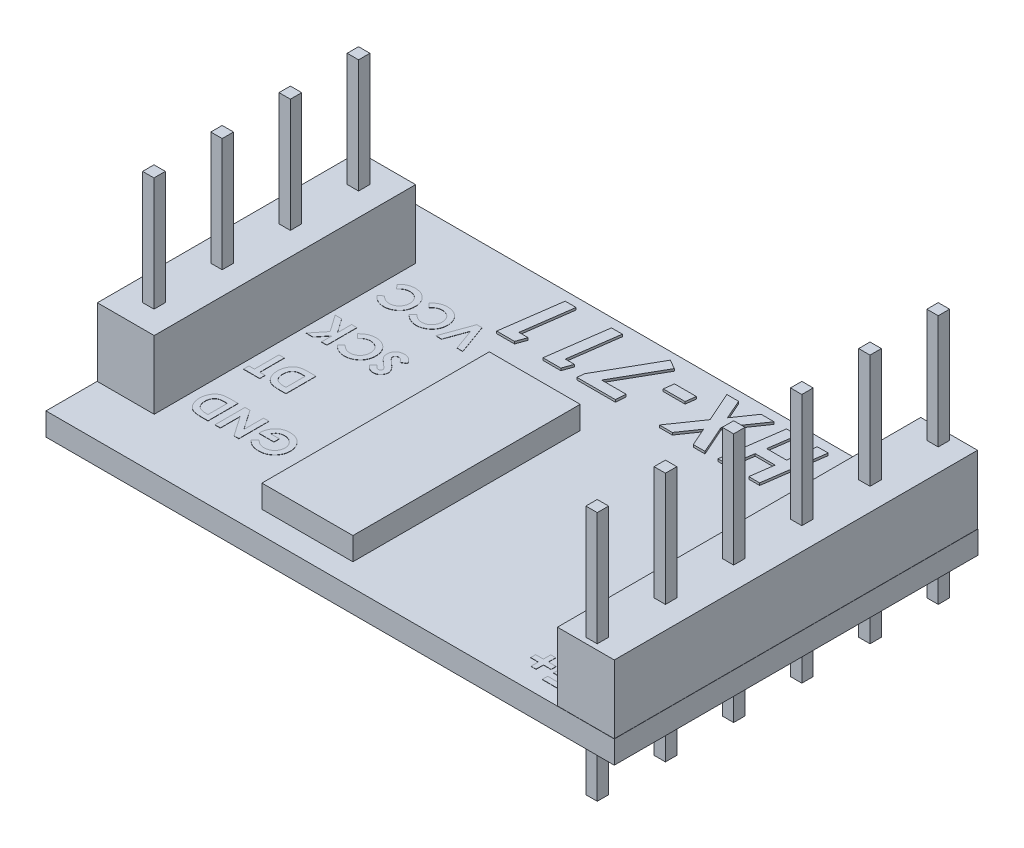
from build123d import *

# Parameters (mm, degrees)
SKETCH1_W                 = 25
SKETCH1_H                 = 16
BOSS_EXTRUDE1_DEPTH       = 1
F_4_0MM_DOWEL_HOLE1_D     = 0.5
F_4_0MM_DOWEL_HOLE1_DEPTH = 15
F_4_0MM_DOWEL_HOLE1_TIP   = 0.150215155
BOSS_EXTRUDE2_DEPTH       = 0.1
SKETCH5_W                 = 4
SKETCH5_H                 = 10
BOSS_EXTRUDE3_DEPTH       = 1
BOSS_EXTRUDE4_DEPTH       = 8
BOSS_EXTRUDE4_DEPTH_BACK  = 3
SKETCH6_W                 = 0.5
SKETCH6_H                 = 0.5
SKETCH7_W                 = 2.5
SKETCH7_H                 = 15.98
SKETCH7_H_2               = 11.5
BOSS_EXTRUDE5_DEPTH       = 3
SKETCH8_W                 = 0.457932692
SKETCH8_H                 = 0.220486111
BOSS_EXTRUDE6_DEPTH       = 0.01


with BuildPart() as part:
    # Sketch1 → Boss-Extrude1 (new body)
    with BuildSketch(Plane(origin=(0, 0, 0), x_dir=(1, 0, 0), z_dir=(0, 1, 0))):
        with Locations((12.5, -8)):
            Rectangle(SKETCH1_W, SKETCH1_H)
    extrude(amount=BOSS_EXTRUDE1_DEPTH)

    # 4.0mm Dowel Hole1
    with Locations(Plane(origin=(1.25, 1, 3.5), x_dir=(0, 0, 1), z_dir=(0, 1, 0))):
        with Locations((0, 0), (3, 0), (6, 0), (9, 0), (12, 22.5), (9, 22.5), (6, 22.5), (3, 22.5), (0, 22.5), (-3, 22.5)):
            Hole(F_4_0MM_DOWEL_HOLE1_D / 2, depth=F_4_0MM_DOWEL_HOLE1_DEPTH)
            with Locations((0, 0, -(F_4_0MM_DOWEL_HOLE1_DEPTH + F_4_0MM_DOWEL_HOLE1_TIP / 2))):  # 118° drill point
                Cone(0, F_4_0MM_DOWEL_HOLE1_D / 2, F_4_0MM_DOWEL_HOLE1_TIP, mode=Mode.SUBTRACT)

    # Sketch4 → Boss-Extrude2 (add)
    with BuildSketch(Plane(origin=(0, 1, 0), x_dir=(1, 0, 0), z_dir=(0, 1, 0))):
        Polygon((7.757428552, -3.145833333), (6.971946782, -3.145833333), (7.339776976, -0.5), (7.818910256, -0.5), (7.512561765, -2.704861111), (7.91537293, -2.704861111), align=None)
        Polygon((9.792684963, -3.145833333), (9.007203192, -3.145833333), (9.375033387, -0.5), (9.854166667, -0.5), (9.547818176, -2.704861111), (9.95062934, -2.704861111), align=None)
        Polygon((12.194711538, -3.145833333), (10.49866453, -3.145833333), (10.53258547, -2.83471471), (11.901613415, -0.43215812), (12.307604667, -0.669604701), (11.147932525, -2.704861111), (12.228632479, -2.704861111), align=None)
        Polygon((13.79959602, -1.687232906), (12.839209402, -1.687232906), (12.894330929, -1.246260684), (13.856837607, -1.246260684), align=None)
        Polygon((16.136430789, -3.145833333), (15.620196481, -3.145833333), (15.261376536, -2.332260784), (14.69797092, -3.145833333), (14.128205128, -3.145833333), (15.039300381, -1.829806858), (14.452574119, -0.5), (14.968278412, -0.5), (15.354659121, -1.374524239), (15.959935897, -0.5), (16.529701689, -0.5), (15.576205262, -1.876978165), align=None)
        Polygon((18.540047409, -3.145833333), (18.060914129, -3.145833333), (18.203488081, -2.128205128), (17.325253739, -2.128205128), (17.183209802, -3.145833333), (16.704076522, -3.145833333), (17.075086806, -0.5), (17.554220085, -0.5), (17.387795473, -1.687232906), (18.2654998, -1.687232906), (18.431924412, -0.5), (18.911057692, -0.5), align=None)
    extrude(amount=BOSS_EXTRUDE2_DEPTH)

    # Sketch5 → Boss-Extrude3 (add)
    with BuildSketch(Plane(origin=(0, 1, 0), x_dir=(1, 0, 0), z_dir=(0, 1, 0))):
        with Locations((10.5, -10)):
            Rectangle(SKETCH5_W, SKETCH5_H)
    extrude(amount=BOSS_EXTRUDE3_DEPTH)

    # Sketch6 → Boss-Extrude4 (add, two sides: drawn at the far end of the back side and taken through both)
    with BuildSketch(Plane(origin=(0, 1, 0), x_dir=(1, 0, 0), z_dir=(0, 1, 0)).offset(-BOSS_EXTRUDE4_DEPTH_BACK)):
        with Locations((1.25, -6.5)):
            Rectangle(SKETCH6_W, SKETCH6_H)
        with Locations((1.25, -3.5)):
            Rectangle(SKETCH6_W, SKETCH6_H)
        with Locations((1.25, -9.5)):
            Rectangle(SKETCH6_W, SKETCH6_H)
        with Locations((1.25, -12.5)):
            Rectangle(SKETCH6_W, SKETCH6_H)
        with Locations((23.75, -3.5)):
            Rectangle(SKETCH6_W, SKETCH6_H)
        with Locations((23.75, -0.5)):
            Rectangle(SKETCH6_W, SKETCH6_H)
        with Locations((23.75, -6.5)):
            Rectangle(SKETCH6_W, SKETCH6_H)
        with Locations((23.75, -9.5)):
            Rectangle(SKETCH6_W, SKETCH6_H)
        with Locations((23.75, -12.5)):
            Rectangle(SKETCH6_W, SKETCH6_H)
        with Locations((23.75, -15.5)):
            Rectangle(SKETCH6_W, SKETCH6_H)
    extrude(amount=BOSS_EXTRUDE4_DEPTH + BOSS_EXTRUDE4_DEPTH_BACK)

    # Sketch7 → Boss-Extrude5 (add)
    with BuildSketch(Plane(origin=(0, 1, 0), x_dir=(1, 0, 0), z_dir=(0, 1, 0))):
        with Locations((23.74, -8)):
            Rectangle(SKETCH7_W, SKETCH7_H)
        with Locations((1.26, -8)):
            Rectangle(SKETCH7_W, SKETCH7_H_2)
    extrude(amount=BOSS_EXTRUDE5_DEPTH)

    # Sketch8 → Boss-Extrude6 (add)
    # profile 1 of 23: a face of its own
    with BuildSketch(Plane(origin=(0, 1, 0), x_dir=(1, 0, 0), z_dir=(0, 1, 0))):
        Polygon((21.865941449, -15.322916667), (21.153601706, -15.322916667), (21.153601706, -15.085470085), (21.628494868, -15.085470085), (21.628494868, -14.831063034), (21.153601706, -14.831063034), (21.153601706, -14.593616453), (21.628494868, -14.593616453), (21.628494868, -14.237446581), (21.153601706, -14.237446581), (21.153601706, -14), (21.865941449, -14), align=None)
    # profile 2 of 23: a face of its own
    with BuildSketch(Plane(origin=(0, 1, 0), x_dir=(1, 0, 0), z_dir=(0, 1, 0))):
        Polygon((20.627827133, -14.746260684), (20.627827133, -15.068509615), (20.407341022, -15.068509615), (20.407341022, -14.746260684), (20.06813162, -14.746260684), (20.06813162, -14.525774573), (20.407341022, -14.525774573), (20.407341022, -14.203525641), (20.627827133, -14.203525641), (20.627827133, -14.525774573), (20.967036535, -14.525774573), (20.967036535, -14.746260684), align=None)
    # profile 3 of 23: a face of its own
    with BuildSketch(Plane(origin=(0, 1, 0), x_dir=(1, 0, 0), z_dir=(0, 1, 0))):
        Polygon((21.865941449, -12.572916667), (21.153601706, -12.572916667), (21.153601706, -12.335470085), (21.628494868, -12.335470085), (21.628494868, -12.081063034), (21.153601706, -12.081063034), (21.153601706, -11.843616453), (21.628494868, -11.843616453), (21.628494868, -11.487446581), (21.153601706, -11.487446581), (21.153601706, -11.25), (21.865941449, -11.25), align=None)
    # profile 4 of 23: a face of its own
    with BuildSketch(Plane(origin=(0, 1, 0), x_dir=(1, 0, 0), z_dir=(0, 1, 0))):
        with Locations((20.687188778, -11.733373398)):
            Rectangle(SKETCH8_W, SKETCH8_H)
    # profile 5 of 23: a face of its own
    with BuildSketch(Plane(origin=(0, 1, 0), x_dir=(1, 0, 0), z_dir=(0, 1, 0))):
        Polygon((21.45862516, -9.822916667), (21.238404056, -9.822916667), (20.704149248, -8.5), (20.957761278, -8.5), (21.060584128, -8.771367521), (21.636975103, -8.771367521), (21.739797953, -8.5), (21.993144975, -8.5), align=None)
        Polygon((21.348647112, -9.468071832), (21.546872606, -9.008814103), (21.150421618, -9.008814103), align=None, mode=Mode.SUBTRACT)
    # profile 6 of 23: a face of its own
    with BuildSketch(Plane(origin=(0, 1, 0), x_dir=(1, 0, 0), z_dir=(0, 1, 0))):
        with Locations((20.280137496, -8.983373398)):
            Rectangle(SKETCH8_W, SKETCH8_H)
    # profile 7 of 23: a face of its own
    with BuildSketch(Plane(origin=(0, 1, 0), x_dir=(1, 0, 0), z_dir=(0, 1, 0))):
        Polygon((21.45862516, -7.072916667), (21.238404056, -7.072916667), (20.704149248, -5.75), (20.957761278, -5.75), (21.060584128, -6.021367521), (21.636975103, -6.021367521), (21.739797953, -5.75), (21.993144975, -5.75), align=None)
        Polygon((21.348647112, -6.718071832), (21.546872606, -6.258814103), (21.150421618, -6.258814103), align=None, mode=Mode.SUBTRACT)
    # profile 8 of 23: a face of its own
    with BuildSketch(Plane(origin=(0, 1, 0), x_dir=(1, 0, 0), z_dir=(0, 1, 0))):
        Polygon((20.220775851, -6.496260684), (20.220775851, -6.818509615), (20.00028974, -6.818509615), (20.00028974, -6.496260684), (19.661080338, -6.496260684), (19.661080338, -6.275774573), (20.00028974, -6.275774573), (20.00028974, -5.953525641), (20.220775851, -5.953525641), (20.220775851, -6.275774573), (20.559985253, -6.275774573), (20.559985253, -6.496260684), align=None)
    # profile 9 of 23: a face of its own
    with BuildSketch(Plane(origin=(0, 1, 0), x_dir=(1, 0, 0), z_dir=(0, 1, 0))):
        with BuildLine():
            Line((21.865941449, -3), (21.865941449, -4.322916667))
            Line((21.865941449, -4.322916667), (21.653935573, -4.322916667))
            add(Edge.make_bspline(
                [(21.653935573, -4.322916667), (21.63909381, -4.322918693), (21.610375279, -4.322922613), (21.568942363, -4.321463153), (21.530603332, -4.319600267), (21.4953114, -4.317446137), (21.463079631, -4.313871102), (21.433885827, -4.310023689), (21.407838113, -4.305414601), (21.391734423, -4.301277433), (21.384158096, -4.299331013)],
                knots=[0, 0, 0, 0, 1.311970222, 2.538637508, 3.664491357, 4.705491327, 5.663608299, 6.530571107, 7.308675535, 8, 8, 8, 8], degree=3))
            add(Edge.make_bspline(
                [(21.384158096, -4.299331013), (21.374209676, -4.296585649), (21.354687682, -4.291198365), (21.326724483, -4.28032048), (21.300203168, -4.268221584), (21.275129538, -4.254445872), (21.251800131, -4.238736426), (21.229895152, -4.221392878), (21.209516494, -4.202409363), (21.190988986, -4.181673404), (21.17426598, -4.159731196), (21.159676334, -4.136572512), (21.147074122, -4.112564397), (21.1373974, -4.08729251), (21.129271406, -4.061416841), (21.123834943, -4.034411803), (21.120187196, -4.006510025), (21.119851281, -3.987517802), (21.119680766, -3.977877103)],
                knots=[0, 0, 0, 0, 1.099879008, 2.158315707, 3.195196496, 4.207130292, 5.205157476, 6.190838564, 7.183874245, 8.171129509, 9.152705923, 10.122275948, 11.08707516, 12.038677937, 13.004120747, 13.975884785, 14.972532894, 16, 16, 16, 16], degree=3))
            add(Edge.make_bspline(
                [(21.119680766, -3.977877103), (21.120094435, -3.965484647), (21.120909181, -3.941076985), (21.127161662, -3.905392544), (21.137237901, -3.871479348), (21.151476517, -3.839043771), (21.170591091, -3.808134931), (21.194427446, -3.778166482), (21.223578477, -3.74954761), (21.245567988, -3.732017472), (21.25695457, -3.722940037)],
                knots=[0, 0, 0, 0, 0.986462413, 1.942894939, 2.875435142, 3.798266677, 4.755009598, 5.761362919, 6.840791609, 8, 8, 8, 8], degree=3))
            add(Edge.make_bspline(
                [(21.25695457, -3.722940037), (21.247626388, -3.718179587), (21.229336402, -3.708845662), (21.20338608, -3.69348588), (21.179298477, -3.677215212), (21.157240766, -3.660058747), (21.136690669, -3.642357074), (21.118924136, -3.623025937), (21.102185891, -3.603557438), (21.087855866, -3.582696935), (21.075466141, -3.56089015), (21.06447479, -3.538383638), (21.055496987, -3.514729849), (21.047768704, -3.490267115), (21.041912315, -3.464742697), (21.03812468, -3.43831573), (21.035218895, -3.411001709), (21.03499318, -3.392395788), (21.034878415, -3.382935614)],
                knots=[0, 0, 0, 0, 1.164301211, 2.282872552, 3.350830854, 4.394111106, 5.389302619, 6.362088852, 7.310365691, 8.24222091, 9.170601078, 10.097577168, 11.024240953, 11.981127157, 12.948542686, 13.932080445, 14.948567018, 16, 16, 16, 16], degree=3))
            add(Edge.make_bspline(
                [(21.034878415, -3.382935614), (21.035586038, -3.364857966), (21.036983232, -3.329163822), (21.048289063, -3.276957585), (21.066334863, -3.227209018), (21.091637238, -3.180715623), (21.122467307, -3.138302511), (21.157768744, -3.100843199), (21.197576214, -3.069473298), (21.234056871, -3.048084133), (21.265777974, -3.03382228), (21.292160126, -3.025083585), (21.320476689, -3.016983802), (21.351044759, -3.010708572), (21.383711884, -3.006032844), (21.418463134, -3.002626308), (21.455418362, -3.000477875), (21.480794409, -3.000162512), (21.493871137, -3)],
                knots=[0, 0, 0, 0, 1.284225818, 2.535691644, 3.779474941, 5.035581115, 6.285533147, 7.498311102, 8.683187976, 9.876672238, 10.49522506, 11.152635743, 11.850557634, 12.588370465, 13.369094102, 14.195874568, 15.07030211, 16, 16, 16, 16], degree=3))
            Line((21.493871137, -3), (21.865941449, -3))
        make_face()
        with BuildLine():
            Line((21.628494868, -4.085470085), (21.628494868, -3.797142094))
            Line((21.628494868, -3.797142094), (21.56542312, -3.797142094))
            add(Edge.make_bspline(
                [(21.56542312, -3.797142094), (21.556850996, -3.797216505), (21.54030303, -3.79736015), (21.51640297, -3.799223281), (21.494173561, -3.802378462), (21.473644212, -3.806874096), (21.454695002, -3.812321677), (21.437550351, -3.819250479), (21.422154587, -3.827517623), (21.404014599, -3.839531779), (21.385329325, -3.85792998), (21.368597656, -3.883900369), (21.358791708, -3.913960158), (21.357694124, -3.935139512), (21.357127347, -3.946076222)],
                knots=[0, 0, 0, 0, 1.06517797, 2.056261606, 2.976983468, 3.853439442, 4.666321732, 5.424739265, 6.146762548, 6.834937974, 8.123729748, 9.372478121, 10.64318598, 12, 12, 12, 12], degree=3))
            add(Edge.make_bspline(
                [(21.357127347, -3.946076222), (21.357580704, -3.956320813), (21.358457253, -3.976128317), (21.368337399, -4.003958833), (21.383728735, -4.028494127), (21.401626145, -4.045528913), (21.418692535, -4.056981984), (21.433383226, -4.0646188), (21.449527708, -4.071399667), (21.467522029, -4.076134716), (21.486826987, -4.080579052), (21.507858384, -4.083281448), (21.530403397, -4.085276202), (21.545984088, -4.085404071), (21.554027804, -4.085470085)],
                knots=[0, 0, 0, 0, 1.347812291, 2.605940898, 3.848830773, 5.144272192, 5.83350599, 6.558918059, 7.32804622, 8.140548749, 9.012446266, 9.943019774, 10.938059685, 12, 12, 12, 12], degree=3))
            Line((21.554027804, -4.085470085), (21.628494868, -4.085470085))
        make_face(mode=Mode.SUBTRACT)
        with BuildLine():
            Line((21.628494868, -3.576655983), (21.628494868, -3.237446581))
            Line((21.628494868, -3.237446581), (21.560122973, -3.237446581))
            add(Edge.make_bspline(
                [(21.560122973, -3.237446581), (21.546606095, -3.237525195), (21.52061821, -3.23767634), (21.483385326, -3.239451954), (21.449549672, -3.242745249), (21.419103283, -3.246590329), (21.392295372, -3.252670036), (21.368636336, -3.258991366), (21.348536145, -3.267122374), (21.331651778, -3.276551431), (21.317530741, -3.287217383), (21.305302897, -3.298760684), (21.295103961, -3.311659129), (21.286901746, -3.325627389), (21.28001156, -3.340536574), (21.275790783, -3.356881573), (21.272592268, -3.374154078), (21.272415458, -3.386099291), (21.272324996, -3.392210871)],
                knots=[0, 0, 0, 0, 1.753677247, 3.371663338, 4.833688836, 6.164395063, 7.349095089, 8.3975697, 9.338276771, 10.154261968, 10.899224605, 11.628775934, 12.330426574, 13.024264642, 13.727131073, 14.452891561, 15.208446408, 16, 16, 16, 16], degree=3))
            add(Edge.make_bspline(
                [(21.272324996, -3.392210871), (21.272523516, -3.399199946), (21.27291018, -3.412812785), (21.276078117, -3.432705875), (21.281809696, -3.451290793), (21.289141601, -3.469049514), (21.29904023, -3.485497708), (21.311131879, -3.500744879), (21.325309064, -3.514835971), (21.341616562, -3.527984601), (21.360550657, -3.539795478), (21.382546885, -3.549348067), (21.407036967, -3.557965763), (21.434500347, -3.564627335), (21.464721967, -3.570341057), (21.497963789, -3.573738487), (21.533936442, -3.576270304), (21.558881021, -3.576524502), (21.571783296, -3.576655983)],
                knots=[0, 0, 0, 0, 0.844862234, 1.645564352, 2.426138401, 3.19188377, 3.963047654, 4.738710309, 5.53926994, 6.37496817, 7.267116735, 8.227971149, 9.268346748, 10.402975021, 11.641070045, 12.984514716, 14.440277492, 16, 16, 16, 16], degree=3))
            Line((21.571783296, -3.576655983), (21.628494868, -3.576655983))
        make_face(mode=Mode.SUBTRACT)
    # profile 10 of 23: a face of its own
    with BuildSketch(Plane(origin=(0, 1, 0), x_dir=(1, 0, 0), z_dir=(0, 1, 0))):
        with Locations((20.568465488, -3.483373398)):
            Rectangle(SKETCH8_W, SKETCH8_H)
    # profile 11 of 23: a face of its own
    with BuildSketch(Plane(origin=(0, 1, 0), x_dir=(1, 0, 0), z_dir=(0, 1, 0))):
        with BuildLine():
            Line((21.865941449, -0.25), (21.865941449, -1.572916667))
            Line((21.865941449, -1.572916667), (21.653935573, -1.572916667))
            add(Edge.make_bspline(
                [(21.653935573, -1.572916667), (21.63909381, -1.572918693), (21.610375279, -1.572922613), (21.568942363, -1.571463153), (21.530603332, -1.569600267), (21.4953114, -1.567446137), (21.463079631, -1.563871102), (21.433885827, -1.560023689), (21.407838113, -1.555414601), (21.391734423, -1.551277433), (21.384158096, -1.549331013)],
                knots=[0, 0, 0, 0, 1.311970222, 2.538637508, 3.664491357, 4.705491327, 5.663608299, 6.530571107, 7.308675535, 8, 8, 8, 8], degree=3))
            add(Edge.make_bspline(
                [(21.384158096, -1.549331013), (21.374209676, -1.546585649), (21.354687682, -1.541198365), (21.326724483, -1.53032048), (21.300203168, -1.518221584), (21.275129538, -1.504445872), (21.251800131, -1.488736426), (21.229895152, -1.471392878), (21.209516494, -1.452409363), (21.190988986, -1.431673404), (21.17426598, -1.409731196), (21.159676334, -1.386572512), (21.147074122, -1.362564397), (21.1373974, -1.33729251), (21.129271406, -1.311416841), (21.123834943, -1.284411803), (21.120187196, -1.256510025), (21.119851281, -1.237517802), (21.119680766, -1.227877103)],
                knots=[0, 0, 0, 0, 1.099879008, 2.158315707, 3.195196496, 4.207130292, 5.205157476, 6.190838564, 7.183874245, 8.171129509, 9.152705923, 10.122275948, 11.08707516, 12.038677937, 13.004120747, 13.975884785, 14.972532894, 16, 16, 16, 16], degree=3))
            add(Edge.make_bspline(
                [(21.119680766, -1.227877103), (21.120094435, -1.215484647), (21.120909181, -1.191076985), (21.127161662, -1.155392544), (21.137237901, -1.121479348), (21.151476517, -1.089043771), (21.170591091, -1.058134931), (21.194427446, -1.028166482), (21.223578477, -0.99954761), (21.245567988, -0.982017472), (21.25695457, -0.972940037)],
                knots=[0, 0, 0, 0, 0.986462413, 1.942894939, 2.875435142, 3.798266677, 4.755009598, 5.761362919, 6.840791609, 8, 8, 8, 8], degree=3))
            add(Edge.make_bspline(
                [(21.25695457, -0.972940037), (21.247626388, -0.968179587), (21.229336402, -0.958845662), (21.20338608, -0.94348588), (21.179298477, -0.927215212), (21.157240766, -0.910058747), (21.136690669, -0.892357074), (21.118924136, -0.873025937), (21.102185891, -0.853557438), (21.087855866, -0.832696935), (21.075466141, -0.81089015), (21.06447479, -0.788383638), (21.055496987, -0.764729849), (21.047768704, -0.740267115), (21.041912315, -0.714742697), (21.03812468, -0.68831573), (21.035218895, -0.661001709), (21.03499318, -0.642395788), (21.034878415, -0.632935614)],
                knots=[0, 0, 0, 0, 1.164301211, 2.282872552, 3.350830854, 4.394111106, 5.389302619, 6.362088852, 7.310365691, 8.24222091, 9.170601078, 10.097577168, 11.024240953, 11.981127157, 12.948542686, 13.932080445, 14.948567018, 16, 16, 16, 16], degree=3))
            add(Edge.make_bspline(
                [(21.034878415, -0.632935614), (21.035586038, -0.614857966), (21.036983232, -0.579163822), (21.048289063, -0.526957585), (21.066334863, -0.477209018), (21.091637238, -0.430715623), (21.122467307, -0.388302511), (21.157768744, -0.350843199), (21.197576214, -0.319473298), (21.234056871, -0.298084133), (21.265777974, -0.28382228), (21.292160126, -0.275083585), (21.320476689, -0.266983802), (21.351044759, -0.260708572), (21.383711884, -0.256032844), (21.418463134, -0.252626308), (21.455418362, -0.250477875), (21.480794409, -0.250162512), (21.493871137, -0.25)],
                knots=[0, 0, 0, 0, 1.284225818, 2.535691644, 3.779474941, 5.035581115, 6.285533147, 7.498311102, 8.683187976, 9.876672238, 10.49522506, 11.152635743, 11.850557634, 12.588370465, 13.369094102, 14.195874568, 15.07030211, 16, 16, 16, 16], degree=3))
            Line((21.493871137, -0.25), (21.865941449, -0.25))
        make_face()
        with BuildLine():
            Line((21.628494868, -1.335470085), (21.628494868, -1.047142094))
            Line((21.628494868, -1.047142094), (21.56542312, -1.047142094))
            add(Edge.make_bspline(
                [(21.56542312, -1.047142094), (21.556850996, -1.047216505), (21.54030303, -1.04736015), (21.51640297, -1.049223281), (21.494173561, -1.052378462), (21.473644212, -1.056874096), (21.454695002, -1.062321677), (21.437550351, -1.069250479), (21.422154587, -1.077517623), (21.404014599, -1.089531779), (21.385329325, -1.10792998), (21.368597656, -1.133900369), (21.358791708, -1.163960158), (21.357694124, -1.185139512), (21.357127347, -1.196076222)],
                knots=[0, 0, 0, 0, 1.06517797, 2.056261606, 2.976983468, 3.853439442, 4.666321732, 5.424739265, 6.146762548, 6.834937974, 8.123729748, 9.372478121, 10.64318598, 12, 12, 12, 12], degree=3))
            add(Edge.make_bspline(
                [(21.357127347, -1.196076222), (21.357580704, -1.206320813), (21.358457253, -1.226128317), (21.368337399, -1.253958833), (21.383728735, -1.278494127), (21.401626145, -1.295528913), (21.418692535, -1.306981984), (21.433383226, -1.3146188), (21.449527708, -1.321399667), (21.467522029, -1.326134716), (21.486826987, -1.330579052), (21.507858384, -1.333281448), (21.530403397, -1.335276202), (21.545984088, -1.335404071), (21.554027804, -1.335470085)],
                knots=[0, 0, 0, 0, 1.347812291, 2.605940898, 3.848830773, 5.144272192, 5.83350599, 6.558918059, 7.32804622, 8.140548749, 9.012446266, 9.943019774, 10.938059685, 12, 12, 12, 12], degree=3))
            Line((21.554027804, -1.335470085), (21.628494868, -1.335470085))
        make_face(mode=Mode.SUBTRACT)
        with BuildLine():
            Line((21.628494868, -0.826655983), (21.628494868, -0.487446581))
            Line((21.628494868, -0.487446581), (21.560122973, -0.487446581))
            add(Edge.make_bspline(
                [(21.560122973, -0.487446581), (21.546606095, -0.487525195), (21.52061821, -0.48767634), (21.483385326, -0.489451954), (21.449549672, -0.492745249), (21.419103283, -0.496590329), (21.392295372, -0.502670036), (21.368636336, -0.508991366), (21.348536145, -0.517122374), (21.331651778, -0.526551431), (21.317530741, -0.537217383), (21.305302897, -0.548760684), (21.295103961, -0.561659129), (21.286901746, -0.575627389), (21.28001156, -0.590536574), (21.275790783, -0.606881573), (21.272592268, -0.624154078), (21.272415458, -0.636099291), (21.272324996, -0.642210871)],
                knots=[0, 0, 0, 0, 1.753677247, 3.371663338, 4.833688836, 6.164395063, 7.349095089, 8.3975697, 9.338276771, 10.154261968, 10.899224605, 11.628775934, 12.330426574, 13.024264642, 13.727131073, 14.452891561, 15.208446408, 16, 16, 16, 16], degree=3))
            add(Edge.make_bspline(
                [(21.272324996, -0.642210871), (21.272523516, -0.649199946), (21.27291018, -0.662812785), (21.276078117, -0.682705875), (21.281809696, -0.701290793), (21.289141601, -0.719049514), (21.29904023, -0.735497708), (21.311131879, -0.750744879), (21.325309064, -0.764835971), (21.341616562, -0.777984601), (21.360550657, -0.789795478), (21.382546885, -0.799348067), (21.407036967, -0.807965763), (21.434500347, -0.814627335), (21.464721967, -0.820341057), (21.497963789, -0.823738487), (21.533936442, -0.826270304), (21.558881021, -0.826524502), (21.571783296, -0.826655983)],
                knots=[0, 0, 0, 0, 0.844862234, 1.645564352, 2.426138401, 3.19188377, 3.963047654, 4.738710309, 5.53926994, 6.37496817, 7.267116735, 8.227971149, 9.268346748, 10.402975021, 11.641070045, 12.984514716, 14.440277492, 16, 16, 16, 16], degree=3))
            Line((21.571783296, -0.826655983), (21.628494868, -0.826655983))
        make_face(mode=Mode.SUBTRACT)
    # profile 12 of 23: a face of its own
    with BuildSketch(Plane(origin=(0, 1, 0), x_dir=(1, 0, 0), z_dir=(0, 1, 0))):
        Polygon((20.509103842, -0.996260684), (20.509103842, -1.318509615), (20.288617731, -1.318509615), (20.288617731, -0.996260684), (19.94940833, -0.996260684), (19.94940833, -0.775774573), (20.288617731, -0.775774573), (20.288617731, -0.453525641), (20.509103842, -0.453525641), (20.509103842, -0.775774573), (20.848313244, -0.775774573), (20.848313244, -0.996260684), align=None)
    # profile 13 of 23: a face of its own
    with BuildSketch(Plane(origin=(0, 1, 0), x_dir=(1, 0, 0), z_dir=(0, 1, 0))):
        with BuildLine():
            Line((3.95025805, -12.822916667), (3.651064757, -12.822916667))
            add(Edge.make_bspline(
                [(3.651064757, -12.822916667), (3.627738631, -12.822757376), (3.582648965, -12.822449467), (3.517332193, -12.818847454), (3.45655049, -12.813558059), (3.400441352, -12.80546288), (3.348802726, -12.796067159), (3.302015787, -12.783484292), (3.259699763, -12.769044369), (3.221410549, -12.752219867), (3.186551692, -12.73248862), (3.153686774, -12.710321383), (3.122436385, -12.685385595), (3.092627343, -12.657623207), (3.064187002, -12.627218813), (3.037782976, -12.593560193), (3.012568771, -12.55751915), (2.988953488, -12.518970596), (2.967932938, -12.477990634), (2.949222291, -12.43522426), (2.933632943, -12.390643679), (2.920939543, -12.344310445), (2.910828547, -12.296358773), (2.903752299, -12.2466973), (2.899378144, -12.19537051), (2.898934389, -12.160583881), (2.898708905, -12.142907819)],
                knots=[0, 0, 0, 0, 1.44349102, 2.790284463, 4.047513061, 5.218094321, 6.297837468, 7.293772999, 8.213586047, 9.062895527, 9.878013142, 10.689252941, 11.514048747, 12.349645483, 13.208421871, 14.087867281, 14.994836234, 15.929653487, 16.883274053, 17.843080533, 18.816554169, 19.803369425, 20.81449504, 21.847452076, 22.906230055, 24, 24, 24, 24], degree=3))
            add(Edge.make_bspline(
                [(2.898708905, -12.142907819), (2.899299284, -12.117965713), (2.900461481, -12.068865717), (2.910252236, -11.996812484), (2.926084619, -11.927740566), (2.9483554, -11.862198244), (2.975933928, -11.800740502), (3.008962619, -11.744598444), (3.046492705, -11.693657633), (3.088857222, -11.64876328), (3.134655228, -11.609939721), (3.182435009, -11.577077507), (3.232153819, -11.550699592), (3.276055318, -11.534227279), (3.314230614, -11.523874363), (3.347698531, -11.517860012), (3.385787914, -11.512281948), (3.42864232, -11.507487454), (3.476388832, -11.504204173), (3.528879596, -11.501936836), (3.586127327, -11.50025206), (3.625887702, -11.500086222), (3.646559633, -11.5)],
                knots=[0, 0, 0, 0, 1.315347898, 2.589339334, 3.828278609, 5.048487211, 6.235212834, 7.375728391, 8.47833097, 9.56625089, 10.624194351, 11.640157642, 12.619895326, 13.585848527, 14.106971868, 14.704705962, 15.37825295, 16.137840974, 16.978850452, 17.902510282, 18.909488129, 20, 20, 20, 20], degree=3))
            Line((3.646559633, -11.5), (3.95025805, -11.5))
            Line((3.95025805, -11.5), (3.95025805, -12.822916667))
        make_face()
        with BuildLine():
            Line((3.712811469, -12.585470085), (3.712811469, -11.737446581))
            Line((3.712811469, -11.737446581), (3.588788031, -11.737446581))
            add(Edge.make_bspline(
                [(3.588788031, -11.737446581), (3.574033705, -11.737518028), (3.545660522, -11.737655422), (3.50464602, -11.739543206), (3.466795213, -11.742608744), (3.432058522, -11.747143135), (3.400356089, -11.752599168), (3.371803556, -11.759347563), (3.346344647, -11.767554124), (3.323769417, -11.777225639), (3.303158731, -11.78826782), (3.284064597, -11.801161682), (3.265636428, -11.815490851), (3.248214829, -11.831663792), (3.231734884, -11.849469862), (3.216294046, -11.868999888), (3.201685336, -11.890194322), (3.18828749, -11.913166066), (3.176032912, -11.937668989), (3.165206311, -11.963479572), (3.156066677, -11.990738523), (3.149126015, -12.019433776), (3.143213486, -12.049387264), (3.138944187, -12.080791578), (3.136618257, -12.11354412), (3.136311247, -12.135837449), (3.136155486, -12.147147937)],
                knots=[0, 0, 0, 0, 1.502729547, 2.8898115, 4.181010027, 5.369596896, 6.45687185, 7.456390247, 8.355533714, 9.177830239, 9.954819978, 10.733423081, 11.521791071, 12.330436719, 13.151797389, 13.990712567, 14.864234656, 15.771624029, 16.697123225, 17.652960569, 18.620374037, 19.622036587, 20.657870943, 21.729319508, 22.8479736, 24, 24, 24, 24], degree=3))
            add(Edge.make_bspline(
                [(3.136155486, -12.147147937), (3.136470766, -12.164479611), (3.137085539, -12.198275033), (3.143051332, -12.24749223), (3.152663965, -12.293779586), (3.166666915, -12.337018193), (3.183886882, -12.377482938), (3.20578243, -12.414652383), (3.231023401, -12.449135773), (3.250994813, -12.469361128), (3.260973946, -12.479467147)],
                knots=[0, 0, 0, 0, 1.138242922, 2.219485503, 3.251901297, 4.239342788, 5.201071, 6.134757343, 7.067992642, 8, 8, 8, 8], degree=3))
            add(Edge.make_bspline(
                [(3.260973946, -12.479467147), (3.270813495, -12.488079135), (3.290909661, -12.505668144), (3.326191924, -12.526744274), (3.365071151, -12.545261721), (3.408436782, -12.559943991), (3.455869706, -12.571555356), (3.507652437, -12.579563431), (3.563507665, -12.584709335), (3.602202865, -12.585211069), (3.622178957, -12.585470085)],
                knots=[0, 0, 0, 0, 0.813307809, 1.661089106, 2.549956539, 3.493439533, 4.508053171, 5.589449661, 6.755572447, 8, 8, 8, 8], degree=3))
            Line((3.622178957, -12.585470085), (3.712811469, -12.585470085))
        make_face(mode=Mode.SUBTRACT)
    # profile 14 of 23: a face of its own
    with BuildSketch(Plane(origin=(0, 1, 0), x_dir=(1, 0, 0), z_dir=(0, 1, 0))):
        Polygon((5.307095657, -12.822916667), (5.093234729, -12.822916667), (4.492993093, -11.952367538), (4.492993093, -12.822916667), (4.255546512, -12.822916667), (4.255546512, -11.5), (4.470997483, -11.5), (5.069649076, -12.367899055), (5.069649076, -11.5), (5.307095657, -11.5), align=None)
    # profile 15 of 23: a face of its own
    with BuildSketch(Plane(origin=(0, 1, 0), x_dir=(1, 0, 0), z_dir=(0, 1, 0))):
        with BuildLine():
            Line((5.638089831, -12.612500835), (5.817764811, -12.440511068))
            add(Edge.make_bspline(
                [(5.817764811, -12.440511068), (5.831989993, -12.454753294), (5.859902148, -12.482698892), (5.905548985, -12.519072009), (5.952825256, -12.54999635), (6.001886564, -12.575424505), (6.052801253, -12.595148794), (6.105468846, -12.609258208), (6.159975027, -12.617626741), (6.196873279, -12.618798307), (6.215540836, -12.619391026)],
                knots=[0, 0, 0, 0, 1.075575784, 2.110457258, 3.113929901, 4.09197124, 5.059417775, 6.02750972, 7.002078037, 8, 8, 8, 8], degree=3))
            add(Edge.make_bspline(
                [(6.215540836, -12.619391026), (6.23172502, -12.618975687), (6.263504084, -12.618160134), (6.310200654, -12.611967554), (6.354820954, -12.601621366), (6.397581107, -12.587294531), (6.438200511, -12.568628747), (6.476925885, -12.546045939), (6.513315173, -12.518981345), (6.547522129, -12.48852525), (6.578605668, -12.455024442), (6.606099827, -12.419466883), (6.629305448, -12.381904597), (6.648169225, -12.342533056), (6.662862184, -12.301504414), (6.673141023, -12.258676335), (6.679727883, -12.214134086), (6.680501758, -12.1837423), (6.680893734, -12.168348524)],
                knots=[0, 0, 0, 0, 1.07509559, 2.111044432, 3.123295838, 4.114414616, 5.101929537, 6.088414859, 7.087392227, 8.109987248, 9.127465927, 10.119435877, 11.091852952, 12.055283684, 13.015060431, 13.981632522, 14.977674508, 16, 16, 16, 16], degree=3))
            add(Edge.make_bspline(
                [(6.680893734, -12.168348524), (6.680524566, -12.152423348), (6.679797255, -12.12104857), (6.6728963, -12.074987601), (6.662078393, -12.030769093), (6.646934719, -11.988341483), (6.627193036, -11.947825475), (6.602886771, -11.909289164), (6.57437472, -11.872562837), (6.541906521, -11.838148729), (6.506567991, -11.806450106), (6.468326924, -11.77904201), (6.42825291, -11.755647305), (6.386092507, -11.736250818), (6.341702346, -11.721941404), (6.295464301, -11.711152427), (6.247170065, -11.704713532), (6.214234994, -11.703925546), (6.197520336, -11.703525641)],
                knots=[0, 0, 0, 0, 1.021985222, 2.013450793, 2.98331293, 3.941376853, 4.900279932, 5.871285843, 6.861761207, 7.88100394, 8.905520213, 9.905129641, 10.896449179, 11.881305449, 12.878594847, 13.885755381, 14.927013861, 16, 16, 16, 16], degree=3))
            add(Edge.make_bspline(
                [(6.197520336, -11.703525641), (6.186647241, -11.703623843), (6.165300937, -11.703816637), (6.133988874, -11.706941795), (6.104001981, -11.711416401), (6.075212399, -11.717316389), (6.047873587, -11.725777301), (6.02161452, -11.735351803), (5.996780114, -11.747214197), (5.973153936, -11.760675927), (5.950714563, -11.776180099), (5.929534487, -11.793656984), (5.909542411, -11.81326569), (5.890393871, -11.834630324), (5.872738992, -11.858374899), (5.85595328, -11.883910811), (5.840257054, -11.911520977), (5.830981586, -11.93101669), (5.826245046, -11.940972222)],
                knots=[0, 0, 0, 0, 1.109467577, 2.178131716, 3.208562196, 4.204278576, 5.174223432, 6.127254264, 7.054993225, 7.9799672, 8.900446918, 9.835649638, 10.779420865, 11.756673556, 12.761211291, 13.796640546, 14.874849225, 16, 16, 16, 16], degree=3))
            Line((5.826245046, -11.940972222), (6.206000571, -11.940972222))
            Line((6.206000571, -11.940972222), (6.206000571, -12.178418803))
            Line((6.206000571, -12.178418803), (5.54639729, -12.178418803))
            Line((5.54639729, -12.178418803), (5.544542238, -12.121972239))
            add(Edge.make_bspline(
                [(5.544542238, -12.121972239), (5.544780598, -12.107475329), (5.545256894, -12.07850738), (5.549609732, -12.035379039), (5.556820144, -11.992822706), (5.566677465, -11.950881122), (5.579031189, -11.909348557), (5.594786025, -11.868622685), (5.613234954, -11.828427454), (5.633905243, -11.788933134), (5.657134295, -11.751038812), (5.682138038, -11.715152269), (5.70858611, -11.681361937), (5.736917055, -11.650088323), (5.767069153, -11.621365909), (5.798678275, -11.594832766), (5.831755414, -11.57025728), (5.866886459, -11.548592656), (5.903480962, -11.529277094), (5.941536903, -11.512104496), (5.981277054, -11.497918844), (6.02252326, -11.48619434), (6.065294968, -11.477175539), (6.109574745, -11.47098434), (6.155391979, -11.466779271), (6.186468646, -11.466315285), (6.202290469, -11.46607906)],
                knots=[0, 0, 0, 0, 1.006947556, 2.012098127, 3.007912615, 4.003802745, 5.003693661, 6.015789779, 7.034654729, 8.075083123, 9.110776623, 10.12033905, 11.112364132, 12.089932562, 13.049221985, 14.003156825, 14.955669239, 15.909347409, 16.867458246, 17.828943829, 18.807340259, 19.796171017, 20.806031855, 21.841452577, 22.901035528, 24, 24, 24, 24], degree=3))
            add(Edge.make_bspline(
                [(6.202290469, -11.46607906), (6.219170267, -11.466317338), (6.252631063, -11.466789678), (6.302038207, -11.471039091), (6.350009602, -11.478443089), (6.396711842, -11.487604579), (6.441903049, -11.500679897), (6.485878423, -11.515740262), (6.528209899, -11.534375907), (6.569245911, -11.555081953), (6.608458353, -11.578804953), (6.645871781, -11.604641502), (6.680974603, -11.633155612), (6.713914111, -11.664054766), (6.744924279, -11.697070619), (6.773701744, -11.732647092), (6.800505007, -11.770440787), (6.82467884, -11.810702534), (6.846630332, -11.852334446), (6.865762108, -11.895086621), (6.881903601, -11.938566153), (6.895340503, -11.982873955), (6.905538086, -12.028060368), (6.913090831, -12.074060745), (6.917291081, -12.120833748), (6.917989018, -12.152263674), (6.918340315, -12.168083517)],
                knots=[0, 0, 0, 0, 1.084248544, 2.149304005, 3.182186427, 4.201621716, 5.204046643, 6.201899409, 7.185482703, 8.172726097, 9.152750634, 10.127173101, 11.09142983, 12.055001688, 13.026594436, 13.998833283, 14.992319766, 16.000574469, 17.013370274, 18.014203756, 19.007155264, 19.990967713, 20.986267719, 21.980774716, 22.98364929, 24, 24, 24, 24], degree=3))
            add(Edge.make_bspline(
                [(6.918340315, -12.168083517), (6.917872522, -12.189665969), (6.916948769, -12.232284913), (6.908360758, -12.295056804), (6.895067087, -12.355723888), (6.875704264, -12.414118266), (6.851294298, -12.470475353), (6.821507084, -12.524745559), (6.786095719, -12.576859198), (6.758672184, -12.609120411), (6.744760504, -12.625486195)],
                knots=[0, 0, 0, 0, 1.034063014, 2.041967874, 3.031271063, 4.007437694, 4.986016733, 5.971461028, 6.970942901, 8, 8, 8, 8], degree=3))
            add(Edge.make_bspline(
                [(6.744760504, -12.625486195), (6.73612348, -12.634954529), (6.718979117, -12.653749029), (6.691573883, -12.67986437), (6.663473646, -12.704413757), (6.634289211, -12.726876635), (6.604173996, -12.747744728), (6.573041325, -12.766626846), (6.541054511, -12.784124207), (6.507964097, -12.799343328), (6.473943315, -12.812988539), (6.438841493, -12.824534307), (6.402921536, -12.834761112), (6.365865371, -12.842541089), (6.328047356, -12.849019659), (6.289199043, -12.853361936), (6.249426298, -12.856544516), (6.222526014, -12.856739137), (6.208915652, -12.856837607)],
                knots=[0, 0, 0, 0, 1.020590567, 2.025856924, 3.013483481, 3.991664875, 4.957826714, 5.930500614, 6.890802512, 7.860442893, 8.829981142, 9.809047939, 10.802672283, 11.803273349, 12.823572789, 13.857849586, 14.916166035, 16, 16, 16, 16], degree=3))
            add(Edge.make_bspline(
                [(6.208915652, -12.856837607), (6.194688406, -12.856618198), (6.166381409, -12.856181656), (6.124293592, -12.853161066), (6.082790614, -12.848501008), (6.042047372, -12.841510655), (6.001927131, -12.832890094), (5.962637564, -12.821845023), (5.923922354, -12.809295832), (5.898718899, -12.79929069), (5.886136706, -12.794295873)],
                knots=[0, 0, 0, 0, 1.03180557, 2.052914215, 3.058998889, 4.059601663, 5.049854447, 6.033765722, 7.018406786, 8, 8, 8, 8], degree=3))
            add(Edge.make_bspline(
                [(5.886136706, -12.794295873), (5.875549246, -12.78968131), (5.854014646, -12.780295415), (5.822705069, -12.763093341), (5.791189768, -12.744120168), (5.760323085, -12.722134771), (5.729211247, -12.698384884), (5.698489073, -12.672046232), (5.667926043, -12.643361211), (5.648164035, -12.622920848), (5.638089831, -12.612500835)],
                knots=[0, 0, 0, 0, 0.894422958, 1.819231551, 2.765348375, 3.743239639, 4.753552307, 5.797344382, 6.877138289, 8, 8, 8, 8], degree=3))
        make_face()
    # profile 16 of 23: a face of its own
    with BuildSketch(Plane(origin=(0, 1, 0), x_dir=(1, 0, 0), z_dir=(0, 1, 0))):
        Polygon((3.475364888, -10.072916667), (2.763025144, -10.072916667), (2.763025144, -9.835470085), (3.000471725, -9.835470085), (3.000471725, -8.75), (3.237918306, -8.75), (3.237918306, -9.835470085), (3.475364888, -9.835470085), align=None)
    # profile 17 of 23: a face of its own
    with BuildSketch(Plane(origin=(0, 1, 0), x_dir=(1, 0, 0), z_dir=(0, 1, 0))):
        with BuildLine():
            Line((4.628676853, -10.072916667), (4.329483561, -10.072916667))
            add(Edge.make_bspline(
                [(4.329483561, -10.072916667), (4.306157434, -10.072757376), (4.261067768, -10.072449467), (4.195750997, -10.068847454), (4.134969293, -10.063558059), (4.078860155, -10.05546288), (4.02722153, -10.046067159), (3.980434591, -10.033484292), (3.938118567, -10.019044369), (3.899829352, -10.002219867), (3.864970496, -9.98248862), (3.832105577, -9.960321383), (3.800855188, -9.935385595), (3.771046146, -9.907623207), (3.742605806, -9.877218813), (3.716201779, -9.843560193), (3.690987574, -9.80751915), (3.667372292, -9.768970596), (3.646351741, -9.727990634), (3.627641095, -9.68522426), (3.612051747, -9.640643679), (3.599358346, -9.594310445), (3.589247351, -9.546358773), (3.582171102, -9.4966973), (3.577796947, -9.44537051), (3.577353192, -9.410583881), (3.577127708, -9.392907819)],
                knots=[0, 0, 0, 0, 1.44349102, 2.790284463, 4.047513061, 5.218094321, 6.297837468, 7.293772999, 8.213586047, 9.062895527, 9.878013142, 10.689252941, 11.514048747, 12.349645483, 13.208421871, 14.087867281, 14.994836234, 15.929653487, 16.883274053, 17.843080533, 18.816554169, 19.803369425, 20.81449504, 21.847452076, 22.906230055, 24, 24, 24, 24], degree=3))
            add(Edge.make_bspline(
                [(3.577127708, -9.392907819), (3.577718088, -9.367965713), (3.578880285, -9.318865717), (3.588671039, -9.246812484), (3.604503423, -9.177740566), (3.626774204, -9.112198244), (3.654352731, -9.050740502), (3.687381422, -8.994598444), (3.724911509, -8.943657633), (3.767276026, -8.89876328), (3.813074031, -8.859939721), (3.860853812, -8.827077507), (3.910572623, -8.800699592), (3.954474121, -8.784227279), (3.992649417, -8.773874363), (4.026117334, -8.767860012), (4.064206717, -8.762281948), (4.107061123, -8.757487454), (4.154807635, -8.754204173), (4.207298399, -8.751936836), (4.26454613, -8.75025206), (4.304306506, -8.750086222), (4.324978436, -8.75)],
                knots=[0, 0, 0, 0, 1.315347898, 2.589339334, 3.828278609, 5.048487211, 6.235212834, 7.375728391, 8.47833097, 9.56625089, 10.624194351, 11.640157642, 12.619895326, 13.585848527, 14.106971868, 14.704705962, 15.37825295, 16.137840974, 16.978850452, 17.902510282, 18.909488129, 20, 20, 20, 20], degree=3))
            Line((4.324978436, -8.75), (4.628676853, -8.75))
            Line((4.628676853, -8.75), (4.628676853, -10.072916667))
        make_face()
        with BuildLine():
            Line((4.391230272, -9.835470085), (4.391230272, -8.987446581))
            Line((4.391230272, -8.987446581), (4.267206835, -8.987446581))
            add(Edge.make_bspline(
                [(4.267206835, -8.987446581), (4.252452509, -8.987518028), (4.224079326, -8.987655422), (4.183064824, -8.989543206), (4.145214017, -8.992608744), (4.110477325, -8.997143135), (4.078774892, -9.002599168), (4.05022236, -9.009347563), (4.024763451, -9.017554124), (4.002188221, -9.027225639), (3.981577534, -9.03826782), (3.9624834, -9.051161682), (3.944055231, -9.065490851), (3.926633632, -9.081663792), (3.910153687, -9.099469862), (3.894712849, -9.118999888), (3.880104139, -9.140194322), (3.866706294, -9.163166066), (3.854451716, -9.187668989), (3.843625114, -9.213479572), (3.83448548, -9.240738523), (3.827544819, -9.269433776), (3.821632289, -9.299387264), (3.81736299, -9.330791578), (3.815037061, -9.36354412), (3.814730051, -9.385837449), (3.814574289, -9.397147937)],
                knots=[0, 0, 0, 0, 1.502729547, 2.8898115, 4.181010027, 5.369596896, 6.45687185, 7.456390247, 8.355533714, 9.177830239, 9.954819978, 10.733423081, 11.521791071, 12.330436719, 13.151797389, 13.990712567, 14.864234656, 15.771624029, 16.697123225, 17.652960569, 18.620374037, 19.622036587, 20.657870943, 21.729319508, 22.8479736, 24, 24, 24, 24], degree=3))
            add(Edge.make_bspline(
                [(3.814574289, -9.397147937), (3.81488957, -9.414479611), (3.815504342, -9.448275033), (3.821470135, -9.49749223), (3.831082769, -9.543779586), (3.845085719, -9.587018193), (3.862305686, -9.627482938), (3.884201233, -9.664652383), (3.909442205, -9.699135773), (3.929413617, -9.719361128), (3.939392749, -9.729467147)],
                knots=[0, 0, 0, 0, 1.138242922, 2.219485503, 3.251901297, 4.239342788, 5.201071, 6.134757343, 7.067992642, 8, 8, 8, 8], degree=3))
            add(Edge.make_bspline(
                [(3.939392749, -9.729467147), (3.949232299, -9.738079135), (3.969328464, -9.755668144), (4.004610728, -9.776744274), (4.043489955, -9.795261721), (4.086855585, -9.809943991), (4.13428851, -9.821555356), (4.18607124, -9.829563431), (4.241926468, -9.834709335), (4.280621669, -9.835211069), (4.30059776, -9.835470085)],
                knots=[0, 0, 0, 0, 0.813307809, 1.661089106, 2.549956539, 3.493439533, 4.508053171, 5.589449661, 6.755572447, 8, 8, 8, 8], degree=3))
            Line((4.30059776, -9.835470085), (4.391230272, -9.835470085))
        make_face(mode=Mode.SUBTRACT)
    # profile 18 of 23: a face of its own
    with BuildSketch(Plane(origin=(0, 1, 0), x_dir=(1, 0, 0), z_dir=(0, 1, 0))):
        Polygon((3.678890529, -7.322916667), (3.441443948, -7.322916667), (3.441443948, -6.857298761), (3.066193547, -7.322916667), (2.76647024, -7.322916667), (3.237918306, -6.737780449), (2.720623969, -6), (3.006566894, -6), (3.441443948, -6.620382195), (3.441443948, -6), (3.678890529, -6), align=None)
    # profile 19 of 23: a face of its own
    with BuildSketch(Plane(origin=(0, 1, 0), x_dir=(1, 0, 0), z_dir=(0, 1, 0))):
        with BuildLine():
            Line((3.91633711, -7.093420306), (4.090446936, -6.926995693))
            add(Edge.make_bspline(
                [(4.090446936, -6.926995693), (4.105199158, -6.942289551), (4.134061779, -6.972211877), (4.180791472, -7.01138346), (4.228831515, -7.04467439), (4.27831637, -7.071808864), (4.32921761, -7.093343), (4.381623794, -7.108365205), (4.435408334, -7.117824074), (4.471753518, -7.118865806), (4.490078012, -7.119391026)],
                knots=[0, 0, 0, 0, 1.115370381, 2.182214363, 3.196266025, 4.180416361, 5.141116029, 6.092551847, 7.038303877, 8, 8, 8, 8], degree=3))
            add(Edge.make_bspline(
                [(4.490078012, -7.119391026), (4.505379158, -7.118967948), (4.535574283, -7.118133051), (4.57990445, -7.111997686), (4.622324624, -7.101603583), (4.662868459, -7.087155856), (4.701736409, -7.068961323), (4.738566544, -7.046092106), (4.773556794, -7.019311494), (4.806298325, -6.98866635), (4.835856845, -6.954936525), (4.862489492, -6.919412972), (4.884549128, -6.881467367), (4.902556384, -6.841653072), (4.916746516, -6.79995571), (4.926817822, -6.756377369), (4.932653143, -6.710819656), (4.933523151, -6.679848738), (4.933965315, -6.664108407)],
                knots=[0, 0, 0, 0, 1.035268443, 2.04298821, 3.02163646, 3.985902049, 4.951223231, 5.920091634, 6.913651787, 7.92868536, 8.949353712, 9.945284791, 10.92850487, 11.913014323, 12.897904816, 13.904240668, 14.934873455, 16, 16, 16, 16], degree=3))
            add(Edge.make_bspline(
                [(4.933965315, -6.664108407), (4.933836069, -6.653061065), (4.933581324, -6.631286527), (4.930863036, -6.5991587), (4.926348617, -6.567919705), (4.920016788, -6.537662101), (4.912045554, -6.508255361), (4.902289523, -6.479891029), (4.890493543, -6.452532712), (4.877291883, -6.426037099), (4.86255601, -6.4006287), (4.846037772, -6.376644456), (4.827922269, -6.354270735), (4.808934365, -6.33272901), (4.787816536, -6.313279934), (4.765514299, -6.294851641), (4.74170766, -6.277900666), (4.716425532, -6.262662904), (4.690422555, -6.248461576), (4.663165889, -6.236701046), (4.635417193, -6.22612903), (4.60668966, -6.218175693), (4.577489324, -6.211257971), (4.547409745, -6.207033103), (4.516736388, -6.203822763), (4.496005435, -6.203625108), (4.485572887, -6.203525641)],
                knots=[0, 0, 0, 0, 1.103833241, 2.175677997, 3.219414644, 4.256521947, 5.263082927, 6.262573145, 7.25136242, 8.238376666, 9.219530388, 10.184343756, 11.145312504, 12.095474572, 13.051075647, 14.010745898, 14.985684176, 15.968306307, 16.959653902, 17.943861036, 18.93268972, 19.924626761, 20.920484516, 21.929288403, 22.957944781, 24, 24, 24, 24], degree=3))
            add(Edge.make_bspline(
                [(4.485572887, -6.203525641), (4.467877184, -6.204036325), (4.433109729, -6.205039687), (4.382091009, -6.212920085), (4.333335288, -6.225824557), (4.294456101, -6.241346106), (4.264034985, -6.256435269), (4.240887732, -6.270192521), (4.217052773, -6.285775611), (4.192693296, -6.303616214), (4.167677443, -6.323502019), (4.142434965, -6.345848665), (4.116323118, -6.369926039), (4.09921737, -6.38711029), (4.090446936, -6.395920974)],
                knots=[0, 0, 0, 0, 1.404640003, 2.759752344, 4.088613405, 5.401587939, 6.076032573, 6.783413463, 7.538272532, 8.336594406, 9.180107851, 10.074881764, 11.012956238, 12, 12, 12, 12], degree=3))
            Line((4.090446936, -6.395920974), (3.921637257, -6.21863106))
            add(Edge.make_bspline(
                [(3.921637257, -6.21863106), (3.933503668, -6.207174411), (3.956664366, -6.184813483), (3.991601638, -6.15306306), (4.026494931, -6.124531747), (4.060501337, -6.098184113), (4.094177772, -6.07478728), (4.127521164, -6.054319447), (4.16015231, -6.036257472), (4.192754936, -6.020924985), (4.225587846, -6.007823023), (4.259355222, -5.996773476), (4.294073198, -5.987127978), (4.33002931, -5.979537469), (4.367063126, -5.973358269), (4.405293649, -5.969275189), (4.444542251, -5.966443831), (4.471080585, -5.966201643), (4.484512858, -5.96607906)],
                knots=[0, 0, 0, 0, 1.244537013, 2.429070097, 3.56066612, 4.644477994, 5.67429546, 6.652817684, 7.595405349, 8.486886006, 9.369351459, 10.26090686, 11.166404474, 12.086719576, 13.0323422, 13.998023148, 14.9867073, 16, 16, 16, 16], degree=3))
            add(Edge.make_bspline(
                [(4.484512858, -5.96607906), (4.509185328, -5.966709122), (4.557462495, -5.967941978), (4.628218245, -5.977045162), (4.695490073, -5.992407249), (4.759398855, -6.01383832), (4.819749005, -6.041666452), (4.876729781, -6.075432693), (4.930246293, -6.115457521), (4.979838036, -6.161144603), (5.024682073, -6.211612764), (5.064363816, -6.265780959), (5.097044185, -6.324038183), (5.124771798, -6.385136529), (5.145549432, -6.4500312), (5.160673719, -6.518135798), (5.169876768, -6.589742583), (5.170893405, -6.63864026), (5.171411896, -6.663578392)],
                knots=[0, 0, 0, 0, 1.07798487, 2.109316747, 3.111276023, 4.08905949, 5.049398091, 6.009992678, 6.978127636, 7.964347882, 8.951383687, 9.924270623, 10.892397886, 11.86520058, 12.851549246, 13.863953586, 14.910602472, 16, 16, 16, 16], degree=3))
            add(Edge.make_bspline(
                [(5.171411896, -6.663578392), (5.171185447, -6.679842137), (5.17073668, -6.712072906), (5.166312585, -6.759674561), (5.15952583, -6.80588507), (5.149866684, -6.850647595), (5.137856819, -6.894117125), (5.122569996, -6.936096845), (5.104863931, -6.976816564), (5.08419229, -7.01589681), (5.061020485, -7.053386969), (5.035687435, -7.089192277), (5.007705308, -7.122956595), (4.977340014, -7.154827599), (4.944843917, -7.185011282), (4.909899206, -7.213293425), (4.872472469, -7.239491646), (4.832945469, -7.263627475), (4.792070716, -7.285792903), (4.749819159, -7.304378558), (4.7070142, -7.320785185), (4.663365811, -7.334037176), (4.618777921, -7.344033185), (4.573591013, -7.351576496), (4.52743588, -7.35579832), (4.496446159, -7.356488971), (4.480802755, -7.356837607)],
                knots=[0, 0, 0, 0, 1.07193642, 2.124315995, 3.14887099, 4.149444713, 5.141371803, 6.119544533, 7.092241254, 8.06650569, 9.031360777, 9.996057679, 10.955696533, 11.919602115, 12.89624813, 13.877605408, 14.880920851, 15.905674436, 16.929600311, 17.943674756, 18.946313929, 19.950355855, 20.947755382, 21.956851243, 22.968632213, 24, 24, 24, 24], degree=3))
            add(Edge.make_bspline(
                [(4.480802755, -7.356837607), (4.467457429, -7.356637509), (4.440905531, -7.356239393), (4.401364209, -7.352926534), (4.362143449, -7.347708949), (4.323363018, -7.339891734), (4.284848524, -7.330424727), (4.246761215, -7.31876393), (4.209206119, -7.304540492), (4.171857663, -7.288806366), (4.135460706, -7.270893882), (4.100331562, -7.250844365), (4.066383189, -7.229182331), (4.033820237, -7.205535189), (4.002413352, -7.180250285), (3.972196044, -7.153328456), (3.943458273, -7.124281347), (3.9254232, -7.103759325), (3.91633711, -7.093420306)],
                knots=[0, 0, 0, 0, 0.996333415, 1.982307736, 2.96084097, 3.949129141, 4.93457382, 5.921430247, 6.92116383, 7.931890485, 8.946633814, 9.948019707, 10.950686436, 11.952094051, 12.951305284, 13.960287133, 14.972390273, 16, 16, 16, 16], degree=3))
        make_face()
    # profile 20 of 23: a face of its own
    with BuildSketch(Plane(origin=(0, 1, 0), x_dir=(1, 0, 0), z_dir=(0, 1, 0))):
        with BuildLine():
            Line((5.374937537, -7.146156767), (5.552492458, -6.983707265))
            add(Edge.make_bspline(
                [(5.552492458, -6.983707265), (5.560096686, -6.9944378), (5.574695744, -7.015038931), (5.598383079, -7.042594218), (5.6219289, -7.066255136), (5.645814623, -7.085345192), (5.669629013, -7.100713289), (5.693878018, -7.111313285), (5.718282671, -7.118130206), (5.734687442, -7.118974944), (5.742767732, -7.119391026)],
                knots=[0, 0, 0, 0, 1.299459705, 2.494781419, 3.587730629, 4.594196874, 5.512431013, 6.380462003, 7.202284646, 8, 8, 8, 8], degree=3))
            add(Edge.make_bspline(
                [(5.742767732, -7.119391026), (5.750307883, -7.119134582), (5.764865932, -7.118639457), (5.785522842, -7.113470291), (5.804086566, -7.105117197), (5.820062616, -7.093578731), (5.832915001, -7.079798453), (5.842908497, -7.065128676), (5.848715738, -7.049133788), (5.849461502, -7.038164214), (5.8498307, -7.032733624)],
                knots=[0, 0, 0, 0, 1.184157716, 2.286297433, 3.324836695, 4.370048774, 5.362957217, 6.276446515, 7.146738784, 8, 8, 8, 8], degree=3))
            add(Edge.make_bspline(
                [(5.8498307, -7.032733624), (5.849596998, -7.027227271), (5.849126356, -7.016138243), (5.844580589, -6.99988589), (5.837728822, -6.98400545), (5.831181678, -6.97433827), (5.82783509, -6.969396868)],
                knots=[0, 0, 0, 0, 0.967525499, 1.948461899, 2.951351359, 4, 4, 4, 4], degree=3))
            add(Edge.make_bspline(
                [(5.82783509, -6.969396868), (5.82478041, -6.965567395), (5.817708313, -6.956701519), (5.804633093, -6.942435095), (5.787536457, -6.925687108), (5.767141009, -6.905613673), (5.742681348, -6.882994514), (5.714682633, -6.857174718), (5.682521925, -6.829031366), (5.659990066, -6.809163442), (5.64816011, -6.798732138)],
                knots=[0, 0, 0, 0, 0.473849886, 1.097042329, 1.870584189, 2.789244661, 3.865562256, 5.093556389, 6.47402294, 8, 8, 8, 8], degree=3))
            add(Edge.make_bspline(
                [(5.64816011, -6.798732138), (5.637029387, -6.789103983), (5.615905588, -6.770831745), (5.585888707, -6.744854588), (5.559337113, -6.721588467), (5.536492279, -6.700859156), (5.51667155, -6.683520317), (5.50075155, -6.668505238), (5.488050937, -6.656470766), (5.480838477, -6.649193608), (5.477760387, -6.646087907)],
                knots=[0, 0, 0, 0, 1.543627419, 2.929484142, 4.163674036, 5.24627963, 6.164986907, 6.925413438, 7.541394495, 8, 8, 8, 8], degree=3))
            add(Edge.make_bspline(
                [(5.477760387, -6.646087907), (5.466075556, -6.633452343), (5.443613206, -6.609162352), (5.414477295, -6.571418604), (5.390239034, -6.534857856), (5.371468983, -6.498447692), (5.357856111, -6.461435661), (5.347946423, -6.423293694), (5.342006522, -6.383476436), (5.34134911, -6.356366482), (5.341016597, -6.342654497)],
                knots=[0, 0, 0, 0, 1.206413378, 2.319150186, 3.339784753, 4.27899982, 5.184598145, 6.099639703, 7.038813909, 8, 8, 8, 8], degree=3))
            add(Edge.make_bspline(
                [(5.341016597, -6.342654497), (5.341253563, -6.32929374), (5.341718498, -6.303079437), (5.347406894, -6.26471693), (5.355529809, -6.228009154), (5.368046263, -6.193323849), (5.38342997, -6.160249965), (5.402178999, -6.12877638), (5.425101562, -6.099637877), (5.450561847, -6.072048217), (5.479163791, -6.047283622), (5.509920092, -6.025450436), (5.542889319, -6.00701613), (5.577820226, -5.991824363), (5.615150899, -5.980550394), (5.654291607, -5.972026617), (5.695636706, -5.966887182), (5.723849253, -5.966352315), (5.738262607, -5.96607906)],
                knots=[0, 0, 0, 0, 1.043039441, 2.046482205, 3.024244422, 3.976033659, 4.920890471, 5.871402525, 6.830893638, 7.812473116, 8.800703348, 9.781190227, 10.754606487, 11.746997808, 12.751247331, 13.796362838, 14.874195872, 16, 16, 16, 16], degree=3))
            add(Edge.make_bspline(
                [(5.738262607, -5.96607906), (5.749577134, -5.966279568), (5.771986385, -5.96667669), (5.805012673, -5.969925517), (5.836909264, -5.975152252), (5.867612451, -5.982701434), (5.89731645, -5.992048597), (5.925698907, -6.004203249), (5.953137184, -6.017948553), (5.979540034, -6.033877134), (6.004688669, -6.052376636), (6.029307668, -6.072716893), (6.052524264, -6.096013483), (6.075225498, -6.121417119), (6.096463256, -6.149664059), (6.117356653, -6.179904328), (6.136885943, -6.212860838), (6.148954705, -6.235975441), (6.155119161, -6.247781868)],
                knots=[0, 0, 0, 0, 1.017088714, 2.014418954, 2.980620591, 3.920647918, 4.854987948, 5.776890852, 6.693269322, 7.612671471, 8.545186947, 9.498010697, 10.480815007, 11.499174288, 12.558697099, 13.655746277, 14.802607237, 16, 16, 16, 16], degree=3))
            Line((6.155119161, -6.247781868), (5.946293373, -6.373130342))
            add(Edge.make_bspline(
                [(5.946293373, -6.373130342), (5.938583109, -6.359728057), (5.923801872, -6.334034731), (5.898753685, -6.299512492), (5.873093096, -6.269949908), (5.846226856, -6.245869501), (5.818481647, -6.226949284), (5.789723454, -6.213427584), (5.759932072, -6.205057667), (5.739639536, -6.204035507), (5.729517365, -6.203525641)],
                knots=[0, 0, 0, 0, 1.283663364, 2.460892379, 3.537111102, 4.529833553, 5.449777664, 6.316464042, 7.160231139, 8, 8, 8, 8], degree=3))
            add(Edge.make_bspline(
                [(5.729517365, -6.203525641), (5.719219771, -6.203938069), (5.69924094, -6.204738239), (5.670676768, -6.212275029), (5.644373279, -6.223843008), (5.621758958, -6.240666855), (5.602555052, -6.259850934), (5.588787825, -6.281487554), (5.579857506, -6.304616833), (5.578929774, -6.320756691), (5.578463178, -6.328874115)],
                knots=[0, 0, 0, 0, 1.13537643, 2.202795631, 3.242191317, 4.290390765, 5.297919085, 6.223733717, 7.106639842, 8, 8, 8, 8], degree=3))
            add(Edge.make_bspline(
                [(5.578463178, -6.328874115), (5.578899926, -6.336422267), (5.579787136, -6.351755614), (5.586286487, -6.374567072), (5.596532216, -6.397267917), (5.608290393, -6.416084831), (5.620548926, -6.431769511), (5.632564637, -6.445155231), (5.646805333, -6.460253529), (5.663633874, -6.476652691), (5.682722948, -6.49466802), (5.704135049, -6.514256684), (5.728100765, -6.535259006), (5.745040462, -6.549564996), (5.753898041, -6.557045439)],
                knots=[0, 0, 0, 0, 0.916057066, 1.860882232, 2.859899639, 3.934694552, 4.546382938, 5.276161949, 6.118633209, 7.067046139, 8.129668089, 9.306861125, 10.591787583, 12, 12, 12, 12], degree=3))
            add(Edge.make_bspline(
                [(5.753898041, -6.557045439), (5.770736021, -6.57129292), (5.803053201, -6.598638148), (5.84872963, -6.639018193), (5.889859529, -6.676785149), (5.926168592, -6.712241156), (5.957764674, -6.745159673), (5.984995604, -6.775251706), (6.007421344, -6.803107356), (6.030675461, -6.836377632), (6.053395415, -6.876347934), (6.072704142, -6.924662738), (6.085183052, -6.972917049), (6.086586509, -7.005366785), (6.087277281, -7.021338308)],
                knots=[0, 0, 0, 0, 1.345685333, 2.582777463, 3.719355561, 4.752181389, 5.678433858, 6.502864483, 7.227563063, 7.858499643, 8.978226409, 10.023061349, 11.026965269, 12, 12, 12, 12], degree=3))
            add(Edge.make_bspline(
                [(6.087277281, -7.021338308), (6.086989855, -7.032664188), (6.086423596, -7.054977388), (6.08138743, -7.087789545), (6.073825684, -7.119435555), (6.062958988, -7.149907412), (6.048383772, -7.178861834), (6.031167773, -7.206767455), (6.010820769, -7.233538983), (5.987500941, -7.258582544), (5.961902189, -7.281603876), (5.934598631, -7.301801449), (5.905842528, -7.318880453), (5.875546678, -7.332793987), (5.843764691, -7.3436514), (5.81046721, -7.35132451), (5.775756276, -7.355900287), (5.752145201, -7.356521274), (5.740117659, -7.356837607)],
                knots=[0, 0, 0, 0, 1.010806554, 1.991397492, 2.957573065, 3.913225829, 4.872777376, 5.846906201, 6.837692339, 7.870332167, 8.898170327, 9.907899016, 10.8981826, 11.879407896, 12.8797257, 13.891947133, 14.926152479, 16, 16, 16, 16], degree=3))
            add(Edge.make_bspline(
                [(5.740117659, -7.356837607), (5.724531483, -7.356265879), (5.693482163, -7.355126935), (5.647561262, -7.34626722), (5.602685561, -7.332187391), (5.566411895, -7.315601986), (5.537797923, -7.299023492), (5.515814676, -7.28406979), (5.493271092, -7.266897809), (5.470581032, -7.247007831), (5.446884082, -7.225549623), (5.423377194, -7.201050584), (5.398909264, -7.174765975), (5.383068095, -7.155860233), (5.374937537, -7.146156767)],
                knots=[0, 0, 0, 0, 1.282890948, 2.555655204, 3.837225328, 5.149160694, 5.83044799, 6.558852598, 7.337307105, 8.162686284, 9.043076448, 9.969084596, 10.957622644, 12, 12, 12, 12], degree=3))
        make_face()
    # profile 21 of 23: a face of its own
    with BuildSketch(Plane(origin=(0, 1, 0), x_dir=(1, 0, 0), z_dir=(0, 1, 0))):
        with BuildLine():
            Line((2.898708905, -4.343420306), (3.07281873, -4.176995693))
            add(Edge.make_bspline(
                [(3.07281873, -4.176995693), (3.087570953, -4.192289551), (3.116433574, -4.222211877), (3.163163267, -4.26138346), (3.21120331, -4.29467439), (3.260688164, -4.321808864), (3.311589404, -4.343343), (3.363995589, -4.358365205), (3.417780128, -4.367824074), (3.454125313, -4.368865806), (3.472449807, -4.369391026)],
                knots=[0, 0, 0, 0, 1.115370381, 2.182214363, 3.196266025, 4.180416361, 5.141116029, 6.092551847, 7.038303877, 8, 8, 8, 8], degree=3))
            add(Edge.make_bspline(
                [(3.472449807, -4.369391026), (3.487750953, -4.368967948), (3.517946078, -4.368133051), (3.562276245, -4.361997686), (3.604696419, -4.351603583), (3.645240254, -4.337155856), (3.684108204, -4.318961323), (3.720938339, -4.296092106), (3.755928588, -4.269311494), (3.78867012, -4.23866635), (3.81822864, -4.204936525), (3.844861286, -4.169412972), (3.866920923, -4.131467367), (3.884928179, -4.091653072), (3.899118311, -4.04995571), (3.909189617, -4.006377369), (3.915024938, -3.960819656), (3.915894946, -3.929848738), (3.91633711, -3.914108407)],
                knots=[0, 0, 0, 0, 1.035268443, 2.04298821, 3.02163646, 3.985902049, 4.951223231, 5.920091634, 6.913651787, 7.92868536, 8.949353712, 9.945284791, 10.92850487, 11.913014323, 12.897904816, 13.904240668, 14.934873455, 16, 16, 16, 16], degree=3))
            add(Edge.make_bspline(
                [(3.91633711, -3.914108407), (3.916207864, -3.903061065), (3.915953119, -3.881286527), (3.913234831, -3.8491587), (3.908720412, -3.817919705), (3.902388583, -3.787662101), (3.894417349, -3.758255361), (3.884661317, -3.729891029), (3.872865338, -3.702532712), (3.859663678, -3.676037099), (3.844927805, -3.6506287), (3.828409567, -3.626644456), (3.810294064, -3.604270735), (3.79130616, -3.58272901), (3.77018833, -3.563279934), (3.747886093, -3.544851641), (3.724079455, -3.527900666), (3.698797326, -3.512662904), (3.67279435, -3.498461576), (3.645537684, -3.486701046), (3.617788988, -3.47612903), (3.589061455, -3.468175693), (3.559861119, -3.461257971), (3.52978154, -3.457033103), (3.499108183, -3.453822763), (3.47837723, -3.453625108), (3.467944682, -3.453525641)],
                knots=[0, 0, 0, 0, 1.103833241, 2.175677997, 3.219414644, 4.256521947, 5.263082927, 6.262573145, 7.25136242, 8.238376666, 9.219530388, 10.184343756, 11.145312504, 12.095474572, 13.051075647, 14.010745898, 14.985684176, 15.968306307, 16.959653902, 17.943861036, 18.93268972, 19.924626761, 20.920484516, 21.929288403, 22.957944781, 24, 24, 24, 24], degree=3))
            add(Edge.make_bspline(
                [(3.467944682, -3.453525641), (3.450248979, -3.454036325), (3.415481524, -3.455039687), (3.364462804, -3.462920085), (3.315707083, -3.475824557), (3.276827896, -3.491346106), (3.24640678, -3.506435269), (3.223259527, -3.520192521), (3.199424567, -3.535775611), (3.175065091, -3.553616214), (3.150049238, -3.573502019), (3.12480676, -3.595848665), (3.098694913, -3.619926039), (3.081589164, -3.63711029), (3.07281873, -3.645920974)],
                knots=[0, 0, 0, 0, 1.404640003, 2.759752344, 4.088613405, 5.401587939, 6.076032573, 6.783413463, 7.538272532, 8.336594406, 9.180107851, 10.074881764, 11.012956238, 12, 12, 12, 12], degree=3))
            Line((3.07281873, -3.645920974), (2.904009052, -3.46863106))
            add(Edge.make_bspline(
                [(2.904009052, -3.46863106), (2.915875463, -3.457174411), (2.939036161, -3.434813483), (2.973973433, -3.40306306), (3.008866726, -3.374531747), (3.042873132, -3.348184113), (3.076549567, -3.32478728), (3.109892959, -3.304319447), (3.142524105, -3.286257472), (3.175126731, -3.270924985), (3.207959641, -3.257823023), (3.241727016, -3.246773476), (3.276444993, -3.237127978), (3.312401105, -3.229537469), (3.349434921, -3.223358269), (3.387665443, -3.219275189), (3.426914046, -3.216443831), (3.45345238, -3.216201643), (3.466884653, -3.21607906)],
                knots=[0, 0, 0, 0, 1.244537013, 2.429070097, 3.56066612, 4.644477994, 5.67429546, 6.652817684, 7.595405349, 8.486886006, 9.369351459, 10.26090686, 11.166404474, 12.086719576, 13.0323422, 13.998023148, 14.9867073, 16, 16, 16, 16], degree=3))
            add(Edge.make_bspline(
                [(3.466884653, -3.21607906), (3.491557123, -3.216709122), (3.53983429, -3.217941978), (3.61059004, -3.227045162), (3.677861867, -3.242407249), (3.74177065, -3.26383832), (3.8021208, -3.291666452), (3.859101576, -3.325432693), (3.912618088, -3.365457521), (3.962209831, -3.411144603), (4.007053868, -3.461612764), (4.046735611, -3.515780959), (4.07941598, -3.574038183), (4.107143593, -3.635136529), (4.127921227, -3.7000312), (4.143045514, -3.768135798), (4.152248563, -3.839742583), (4.1532652, -3.88864026), (4.153783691, -3.913578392)],
                knots=[0, 0, 0, 0, 1.07798487, 2.109316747, 3.111276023, 4.08905949, 5.049398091, 6.009992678, 6.978127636, 7.964347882, 8.951383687, 9.924270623, 10.892397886, 11.86520058, 12.851549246, 13.863953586, 14.910602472, 16, 16, 16, 16], degree=3))
            add(Edge.make_bspline(
                [(4.153783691, -3.913578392), (4.153557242, -3.929842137), (4.153108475, -3.962072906), (4.14868438, -4.009674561), (4.141897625, -4.05588507), (4.132238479, -4.100647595), (4.120228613, -4.144117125), (4.104941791, -4.186096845), (4.087235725, -4.226816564), (4.066564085, -4.26589681), (4.043392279, -4.303386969), (4.01805923, -4.339192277), (3.990077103, -4.372956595), (3.959711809, -4.404827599), (3.927215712, -4.435011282), (3.892271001, -4.463293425), (3.854844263, -4.489491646), (3.815317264, -4.513627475), (3.774442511, -4.535792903), (3.732190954, -4.554378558), (3.689385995, -4.570785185), (3.645737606, -4.584037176), (3.601149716, -4.594033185), (3.555962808, -4.601576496), (3.509807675, -4.60579832), (3.478817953, -4.606488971), (3.46317455, -4.606837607)],
                knots=[0, 0, 0, 0, 1.07193642, 2.124315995, 3.14887099, 4.149444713, 5.141371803, 6.119544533, 7.092241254, 8.06650569, 9.031360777, 9.996057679, 10.955696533, 11.919602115, 12.89624813, 13.877605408, 14.880920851, 15.905674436, 16.929600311, 17.943674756, 18.946313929, 19.950355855, 20.947755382, 21.956851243, 22.968632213, 24, 24, 24, 24], degree=3))
            add(Edge.make_bspline(
                [(3.46317455, -4.606837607), (3.449829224, -4.606637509), (3.423277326, -4.606239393), (3.383736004, -4.602926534), (3.344515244, -4.597708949), (3.305734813, -4.589891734), (3.267220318, -4.580424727), (3.22913301, -4.56876393), (3.191577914, -4.554540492), (3.154229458, -4.538806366), (3.117832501, -4.520893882), (3.082703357, -4.500844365), (3.048754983, -4.479182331), (3.016192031, -4.455535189), (2.984785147, -4.430250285), (2.954567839, -4.403328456), (2.925830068, -4.374281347), (2.907794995, -4.353759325), (2.898708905, -4.343420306)],
                knots=[0, 0, 0, 0, 0.996333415, 1.982307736, 2.96084097, 3.949129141, 4.93457382, 5.921430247, 6.92116383, 7.931890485, 8.946633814, 9.948019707, 10.950686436, 11.952094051, 12.951305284, 13.960287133, 14.972390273, 16, 16, 16, 16], degree=3))
        make_face()
    # profile 22 of 23: a face of its own
    with BuildSketch(Plane(origin=(0, 1, 0), x_dir=(1, 0, 0), z_dir=(0, 1, 0))):
        with BuildLine():
            Line((4.323388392, -4.343420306), (4.497498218, -4.176995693))
            add(Edge.make_bspline(
                [(4.497498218, -4.176995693), (4.51225044, -4.192289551), (4.541113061, -4.222211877), (4.587842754, -4.26138346), (4.635882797, -4.29467439), (4.685367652, -4.321808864), (4.736268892, -4.343343), (4.788675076, -4.358365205), (4.842459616, -4.367824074), (4.8788048, -4.368865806), (4.897129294, -4.369391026)],
                knots=[0, 0, 0, 0, 1.115370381, 2.182214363, 3.196266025, 4.180416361, 5.141116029, 6.092551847, 7.038303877, 8, 8, 8, 8], degree=3))
            add(Edge.make_bspline(
                [(4.897129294, -4.369391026), (4.91243044, -4.368967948), (4.942625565, -4.368133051), (4.986955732, -4.361997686), (5.029375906, -4.351603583), (5.069919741, -4.337155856), (5.108787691, -4.318961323), (5.145617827, -4.296092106), (5.180608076, -4.269311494), (5.213349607, -4.23866635), (5.242908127, -4.204936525), (5.269540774, -4.169412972), (5.29160041, -4.131467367), (5.309607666, -4.091653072), (5.323797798, -4.04995571), (5.333869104, -4.006377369), (5.339704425, -3.960819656), (5.340574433, -3.929848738), (5.341016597, -3.914108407)],
                knots=[0, 0, 0, 0, 1.035268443, 2.04298821, 3.02163646, 3.985902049, 4.951223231, 5.920091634, 6.913651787, 7.92868536, 8.949353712, 9.945284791, 10.92850487, 11.913014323, 12.897904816, 13.904240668, 14.934873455, 16, 16, 16, 16], degree=3))
            add(Edge.make_bspline(
                [(5.341016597, -3.914108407), (5.340887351, -3.903061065), (5.340632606, -3.881286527), (5.337914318, -3.8491587), (5.333399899, -3.817919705), (5.32706807, -3.787662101), (5.319096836, -3.758255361), (5.309340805, -3.729891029), (5.297544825, -3.702532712), (5.284343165, -3.676037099), (5.269607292, -3.6506287), (5.253089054, -3.626644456), (5.234973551, -3.604270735), (5.215985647, -3.58272901), (5.194867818, -3.563279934), (5.172565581, -3.544851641), (5.148758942, -3.527900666), (5.123476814, -3.512662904), (5.097473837, -3.498461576), (5.070217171, -3.486701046), (5.042468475, -3.47612903), (5.013740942, -3.468175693), (4.984540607, -3.461257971), (4.954461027, -3.457033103), (4.923787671, -3.453822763), (4.903056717, -3.453625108), (4.892624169, -3.453525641)],
                knots=[0, 0, 0, 0, 1.103833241, 2.175677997, 3.219414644, 4.256521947, 5.263082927, 6.262573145, 7.25136242, 8.238376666, 9.219530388, 10.184343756, 11.145312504, 12.095474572, 13.051075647, 14.010745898, 14.985684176, 15.968306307, 16.959653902, 17.943861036, 18.93268972, 19.924626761, 20.920484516, 21.929288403, 22.957944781, 24, 24, 24, 24], degree=3))
            add(Edge.make_bspline(
                [(4.892624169, -3.453525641), (4.874928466, -3.454036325), (4.840161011, -3.455039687), (4.789142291, -3.462920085), (4.74038657, -3.475824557), (4.701507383, -3.491346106), (4.671086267, -3.506435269), (4.647939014, -3.520192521), (4.624104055, -3.535775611), (4.599744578, -3.553616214), (4.574728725, -3.573502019), (4.549486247, -3.595848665), (4.5233744, -3.619926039), (4.506268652, -3.63711029), (4.497498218, -3.645920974)],
                knots=[0, 0, 0, 0, 1.404640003, 2.759752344, 4.088613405, 5.401587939, 6.076032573, 6.783413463, 7.538272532, 8.336594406, 9.180107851, 10.074881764, 11.012956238, 12, 12, 12, 12], degree=3))
            Line((4.497498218, -3.645920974), (4.328688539, -3.46863106))
            add(Edge.make_bspline(
                [(4.328688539, -3.46863106), (4.340554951, -3.457174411), (4.363715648, -3.434813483), (4.39865292, -3.40306306), (4.433546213, -3.374531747), (4.467552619, -3.348184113), (4.501229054, -3.32478728), (4.534572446, -3.304319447), (4.567203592, -3.286257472), (4.599806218, -3.270924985), (4.632639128, -3.257823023), (4.666406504, -3.246773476), (4.70112448, -3.237127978), (4.737080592, -3.229537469), (4.774114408, -3.223358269), (4.812344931, -3.219275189), (4.851593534, -3.216443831), (4.878131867, -3.216201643), (4.89156414, -3.21607906)],
                knots=[0, 0, 0, 0, 1.244537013, 2.429070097, 3.56066612, 4.644477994, 5.67429546, 6.652817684, 7.595405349, 8.486886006, 9.369351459, 10.26090686, 11.166404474, 12.086719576, 13.0323422, 13.998023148, 14.9867073, 16, 16, 16, 16], degree=3))
            add(Edge.make_bspline(
                [(4.89156414, -3.21607906), (4.91623661, -3.216709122), (4.964513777, -3.217941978), (5.035269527, -3.227045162), (5.102541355, -3.242407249), (5.166450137, -3.26383832), (5.226800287, -3.291666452), (5.283781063, -3.325432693), (5.337297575, -3.365457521), (5.386889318, -3.411144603), (5.431733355, -3.461612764), (5.471415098, -3.515780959), (5.504095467, -3.574038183), (5.53182308, -3.635136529), (5.552600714, -3.7000312), (5.567725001, -3.768135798), (5.57692805, -3.839742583), (5.577944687, -3.88864026), (5.578463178, -3.913578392)],
                knots=[0, 0, 0, 0, 1.07798487, 2.109316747, 3.111276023, 4.08905949, 5.049398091, 6.009992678, 6.978127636, 7.964347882, 8.951383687, 9.924270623, 10.892397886, 11.86520058, 12.851549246, 13.863953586, 14.910602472, 16, 16, 16, 16], degree=3))
            add(Edge.make_bspline(
                [(5.578463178, -3.913578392), (5.578236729, -3.929842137), (5.577787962, -3.962072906), (5.573363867, -4.009674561), (5.566577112, -4.05588507), (5.556917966, -4.100647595), (5.544908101, -4.144117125), (5.529621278, -4.186096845), (5.511915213, -4.226816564), (5.491243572, -4.26589681), (5.468071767, -4.303386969), (5.442738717, -4.339192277), (5.41475659, -4.372956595), (5.384391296, -4.404827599), (5.351895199, -4.435011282), (5.316950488, -4.463293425), (5.279523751, -4.489491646), (5.239996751, -4.513627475), (5.199121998, -4.535792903), (5.156870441, -4.554378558), (5.114065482, -4.570785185), (5.070417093, -4.584037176), (5.025829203, -4.594033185), (4.980642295, -4.601576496), (4.934487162, -4.60579832), (4.903497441, -4.606488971), (4.887854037, -4.606837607)],
                knots=[0, 0, 0, 0, 1.07193642, 2.124315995, 3.14887099, 4.149444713, 5.141371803, 6.119544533, 7.092241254, 8.06650569, 9.031360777, 9.996057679, 10.955696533, 11.919602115, 12.89624813, 13.877605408, 14.880920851, 15.905674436, 16.929600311, 17.943674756, 18.946313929, 19.950355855, 20.947755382, 21.956851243, 22.968632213, 24, 24, 24, 24], degree=3))
            add(Edge.make_bspline(
                [(4.887854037, -4.606837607), (4.874508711, -4.606637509), (4.847956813, -4.606239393), (4.808415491, -4.602926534), (4.769194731, -4.597708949), (4.7304143, -4.589891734), (4.691899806, -4.580424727), (4.653812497, -4.56876393), (4.616257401, -4.554540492), (4.578908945, -4.538806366), (4.542511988, -4.520893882), (4.507382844, -4.500844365), (4.473434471, -4.479182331), (4.440871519, -4.455535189), (4.409464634, -4.430250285), (4.379247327, -4.403328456), (4.350509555, -4.374281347), (4.332474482, -4.353759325), (4.323388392, -4.343420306)],
                knots=[0, 0, 0, 0, 0.996333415, 1.982307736, 2.96084097, 3.949129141, 4.93457382, 5.921430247, 6.92116383, 7.931890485, 8.946633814, 9.948019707, 10.950686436, 11.952094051, 12.951305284, 13.960287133, 14.972390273, 16, 16, 16, 16], degree=3))
        make_face()
    # profile 23 of 23: a face of its own
    with BuildSketch(Plane(origin=(0, 1, 0), x_dir=(1, 0, 0), z_dir=(0, 1, 0))):
        Polygon((6.90986008, -4.572916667), (6.656248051, -4.572916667), (6.316243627, -3.633200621), (5.975444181, -4.572916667), (5.722627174, -4.572916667), (6.202290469, -3.25), (6.430991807, -3.25), align=None)
    extrude(amount=BOSS_EXTRUDE6_DEPTH)


solid = part.part
